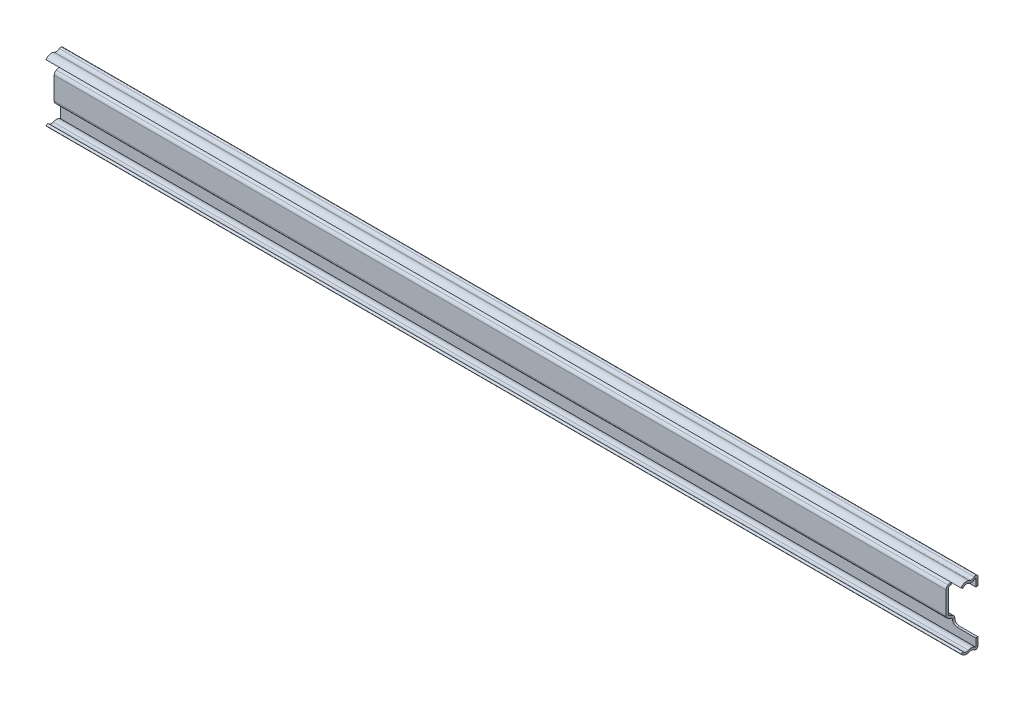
ISO-10303-21;
HEADER;
FILE_DESCRIPTION(('STEP AP214'),'2;1');
FILE_NAME('part.step','',(''),(''),'','','');
FILE_SCHEMA(('AUTOMOTIVE_DESIGN { 1 0 10303 214 1 1 1 1 }'));
ENDSEC;
DATA;
#1=APPLICATION_CONTEXT('core data for automotive mechanical design processes');
#2=APPLICATION_PROTOCOL_DEFINITION('international standard','automotive_design',2000,#1);
#3=PRODUCT_CONTEXT('',#1,'mechanical');
#4=PRODUCT('Part','Part','',(#3));
#5=PRODUCT_RELATED_PRODUCT_CATEGORY('part','',(#4));
#6=PRODUCT_DEFINITION_FORMATION('','',#4);
#7=PRODUCT_DEFINITION_CONTEXT('part definition',#1,'design');
#8=PRODUCT_DEFINITION('design','',#6,#7);
#9=PRODUCT_DEFINITION_SHAPE('','',#8);
#10=(LENGTH_UNIT() NAMED_UNIT(*) SI_UNIT(.MILLI.,.METRE.));
#11=(NAMED_UNIT(*) PLANE_ANGLE_UNIT() SI_UNIT($,.RADIAN.));
#12=(NAMED_UNIT(*) SI_UNIT($,.STERADIAN.) SOLID_ANGLE_UNIT());
#13=UNCERTAINTY_MEASURE_WITH_UNIT(LENGTH_MEASURE(1.E-05),#10,'distance_accuracy_value','');
#14=(GEOMETRIC_REPRESENTATION_CONTEXT(3) GLOBAL_UNCERTAINTY_ASSIGNED_CONTEXT((#13)) GLOBAL_UNIT_ASSIGNED_CONTEXT((#10,
#11,#12)) REPRESENTATION_CONTEXT('',''));
#15=CARTESIAN_POINT('',(0.,0.,0.));
#16=DIRECTION('',(0.,0.,1.));
#17=DIRECTION('',(1.,0.,0.));
#18=AXIS2_PLACEMENT_3D('',#15,#16,#17);
#19=CARTESIAN_POINT('',(-504.063,-16.3765728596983,-3.53059999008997));
#20=DIRECTION('',(0.,0.,-1.));
#21=DIRECTION('',(-1.,0.,0.));
#22=AXIS2_PLACEMENT_3D('',#19,#20,#21);
#23=PLANE('',#22);
#24=DIRECTION('',(0.,1.,0.));
#25=VECTOR('',#24,1.);
#26=CARTESIAN_POINT('',(-16.637,-12.065,-3.53059999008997));
#27=LINE('',#26,#25);
#28=CARTESIAN_POINT('',(-16.637,9.52173798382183,-3.53059999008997));
#29=VERTEX_POINT('',#28);
#30=CARTESIAN_POINT('',(-16.637,9.525,-3.53059999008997));
#31=VERTEX_POINT('',#30);
#32=EDGE_CURVE('E478',#29,#31,#27,.T.);
#33=ORIENTED_EDGE('',*,*,#32,.F.);
#34=DIRECTION('',(1.,0.,0.));
#35=VECTOR('',#34,1.);
#36=CARTESIAN_POINT('',(-504.063,9.52173798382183,-3.53059999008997));
#37=LINE('',#36,#35);
#38=CARTESIAN_POINT('',(-504.063,9.52173798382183,-3.53059999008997));
#39=VERTEX_POINT('',#38);
#40=EDGE_CURVE('E424',#29,#39,#37,.F.);
#41=ORIENTED_EDGE('',*,*,#40,.T.);
#42=DIRECTION('',(0.,1.,0.));
#43=VECTOR('',#42,1.);
#44=CARTESIAN_POINT('',(-504.063,-16.3765728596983,-3.53059999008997));
#45=LINE('',#44,#43);
#46=CARTESIAN_POINT('',(-504.063,16.3765728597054,-3.53059999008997));
#47=VERTEX_POINT('',#46);
#48=EDGE_CURVE('E528',#39,#47,#45,.T.);
#49=ORIENTED_EDGE('',*,*,#48,.T.);
#50=DIRECTION('',(1.,0.,0.));
#51=VECTOR('',#50,1.);
#52=CARTESIAN_POINT('',(-504.063,16.3765728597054,-3.53059999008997));
#53=LINE('',#52,#51);
#54=CARTESIAN_POINT('',(-3.93699999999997,16.3765728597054,-3.53059999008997));
#55=VERTEX_POINT('',#54);
#56=EDGE_CURVE('E295',#47,#55,#53,.T.);
#57=ORIENTED_EDGE('',*,*,#56,.T.);
#58=DIRECTION('',(0.,1.,0.));
#59=VECTOR('',#58,1.);
#60=CARTESIAN_POINT('',(-3.93699999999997,-16.3765728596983,-3.53059999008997));
#61=LINE('',#60,#59);
#62=CARTESIAN_POINT('',(-3.93699999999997,12.065,-3.53059999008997));
#63=VERTEX_POINT('',#62);
#64=EDGE_CURVE('E284',#63,#55,#61,.T.);
#65=ORIENTED_EDGE('',*,*,#64,.F.);
#66=DIRECTION('',(1.,0.,0.));
#67=VECTOR('',#66,1.);
#68=CARTESIAN_POINT('',(-16.637,12.065,-3.53059999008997));
#69=LINE('',#68,#67);
#70=CARTESIAN_POINT('',(-14.097,12.065,-3.53059999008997));
#71=VERTEX_POINT('',#70);
#72=EDGE_CURVE('E269',#71,#63,#69,.T.);
#73=ORIENTED_EDGE('',*,*,#72,.F.);
#74=CARTESIAN_POINT('',(-14.097,9.525,-3.53059999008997));
#75=DIRECTION('',(0.,0.,-1.));
#76=DIRECTION('',(-1.,0.,0.));
#77=AXIS2_PLACEMENT_3D('',#74,#75,#76);
#78=CIRCLE('',#77,2.54);
#79=EDGE_CURVE('E45',#71,#31,#78,.F.);
#80=ORIENTED_EDGE('',*,*,#79,.T.);
#81=EDGE_LOOP('',(#33,#41,#49,#57,#65,#73,#80));
#82=FACE_BOUND('',#81,.T.);
#83=ADVANCED_FACE('F36',(#82),#23,.T.);
#84=CARTESIAN_POINT('',(-504.063,16.3765728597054,-2.31139998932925));
#85=DIRECTION('',(0.,0.,1.));
#86=DIRECTION('',(1.,0.,0.));
#87=AXIS2_PLACEMENT_3D('',#84,#85,#86);
#88=PLANE('',#87);
#89=DIRECTION('',(0.,-1.,0.));
#90=VECTOR('',#89,1.);
#91=CARTESIAN_POINT('',(-16.637,16.3765728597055,-2.31139998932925));
#92=LINE('',#91,#90);
#93=CARTESIAN_POINT('',(-16.637,-9.52173798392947,-2.31139998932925));
#94=VERTEX_POINT('',#93);
#95=CARTESIAN_POINT('',(-16.637,-9.52499999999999,-2.31139998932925));
#96=VERTEX_POINT('',#95);
#97=EDGE_CURVE('E290',#94,#96,#92,.T.);
#98=ORIENTED_EDGE('',*,*,#97,.F.);
#99=DIRECTION('',(-1.,0.,0.));
#100=VECTOR('',#99,1.);
#101=CARTESIAN_POINT('',(-504.063,-9.52173798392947,-2.31139998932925));
#102=LINE('',#101,#100);
#103=CARTESIAN_POINT('',(-504.063,-9.52173798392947,-2.31139998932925));
#104=VERTEX_POINT('',#103);
#105=EDGE_CURVE('E403',#94,#104,#102,.T.);
#106=ORIENTED_EDGE('',*,*,#105,.T.);
#107=DIRECTION('',(0.,-1.,0.));
#108=VECTOR('',#107,1.);
#109=CARTESIAN_POINT('',(-504.063,16.3765728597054,-2.31139998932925));
#110=LINE('',#109,#108);
#111=CARTESIAN_POINT('',(-504.063,-16.3765728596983,-2.31139998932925));
#112=VERTEX_POINT('',#111);
#113=EDGE_CURVE('E633',#104,#112,#110,.T.);
#114=ORIENTED_EDGE('',*,*,#113,.T.);
#115=DIRECTION('',(1.,0.,0.));
#116=VECTOR('',#115,1.);
#117=CARTESIAN_POINT('',(-504.063,-16.3765728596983,-2.31139998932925));
#118=LINE('',#117,#116);
#119=CARTESIAN_POINT('',(-3.93699999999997,-16.3765728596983,-2.31139998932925));
#120=VERTEX_POINT('',#119);
#121=EDGE_CURVE('E349',#112,#120,#118,.T.);
#122=ORIENTED_EDGE('',*,*,#121,.T.);
#123=DIRECTION('',(0.,-1.,0.));
#124=VECTOR('',#123,1.);
#125=CARTESIAN_POINT('',(-3.93699999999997,16.3765728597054,-2.31139998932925));
#126=LINE('',#125,#124);
#127=CARTESIAN_POINT('',(-3.93699999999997,-12.065,-2.31139998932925));
#128=VERTEX_POINT('',#127);
#129=EDGE_CURVE('E583',#128,#120,#126,.T.);
#130=ORIENTED_EDGE('',*,*,#129,.F.);
#131=DIRECTION('',(1.,0.,0.));
#132=VECTOR('',#131,1.);
#133=CARTESIAN_POINT('',(-504.063,-12.0649999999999,-2.31139998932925));
#134=LINE('',#133,#132);
#135=CARTESIAN_POINT('',(-14.097,-12.065,-2.31139998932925));
#136=VERTEX_POINT('',#135);
#137=EDGE_CURVE('E613',#136,#128,#134,.T.);
#138=ORIENTED_EDGE('',*,*,#137,.F.);
#139=CARTESIAN_POINT('',(-14.097,-9.52499999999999,-2.31139998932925));
#140=DIRECTION('',(0.,0.,1.));
#141=DIRECTION('',(1.,0.,0.));
#142=AXIS2_PLACEMENT_3D('',#139,#140,#141);
#143=CIRCLE('',#142,2.54);
#144=EDGE_CURVE('E473',#136,#96,#143,.F.);
#145=ORIENTED_EDGE('',*,*,#144,.T.);
#146=EDGE_LOOP('',(#98,#106,#114,#122,#130,#138,#145));
#147=FACE_BOUND('',#146,.T.);
#148=ADVANCED_FACE('F494',(#147),#88,.T.);
#149=CARTESIAN_POINT('',(-504.063,16.3765728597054,-2.31139998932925));
#150=VERTEX_POINT('',#149);
#151=CARTESIAN_POINT('',(-504.063,9.52173798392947,-2.31139998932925));
#152=VERTEX_POINT('',#151);
#153=EDGE_CURVE('E634',#150,#152,#110,.T.);
#154=ORIENTED_EDGE('',*,*,#153,.T.);
#155=DIRECTION('',(1.,0.,0.));
#156=VECTOR('',#155,1.);
#157=CARTESIAN_POINT('',(-504.063,9.52173798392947,-2.31139998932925));
#158=LINE('',#157,#156);
#159=CARTESIAN_POINT('',(-16.637,9.52173798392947,-2.31139998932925));
#160=VERTEX_POINT('',#159);
#161=EDGE_CURVE('E397',#152,#160,#158,.T.);
#162=ORIENTED_EDGE('',*,*,#161,.T.);
#163=CARTESIAN_POINT('',(-16.637,9.525,-2.31139998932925));
#164=VERTEX_POINT('',#163);
#165=EDGE_CURVE('E356',#164,#160,#92,.T.);
#166=ORIENTED_EDGE('',*,*,#165,.F.);
#167=CARTESIAN_POINT('',(-14.097,9.525,-2.31139998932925));
#168=DIRECTION('',(0.,0.,1.));
#169=DIRECTION('',(1.,0.,0.));
#170=AXIS2_PLACEMENT_3D('',#167,#168,#169);
#171=CIRCLE('',#170,2.54);
#172=CARTESIAN_POINT('',(-14.097,12.065,-2.31139998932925));
#173=VERTEX_POINT('',#172);
#174=EDGE_CURVE('E11',#164,#173,#171,.F.);
#175=ORIENTED_EDGE('',*,*,#174,.T.);
#176=DIRECTION('',(-1.,0.,0.));
#177=VECTOR('',#176,1.);
#178=CARTESIAN_POINT('',(-504.063,12.0649999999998,-2.31139998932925));
#179=LINE('',#178,#177);
#180=CARTESIAN_POINT('',(-3.93699999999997,12.065,-2.31139998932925));
#181=VERTEX_POINT('',#180);
#182=EDGE_CURVE('E584',#181,#173,#179,.T.);
#183=ORIENTED_EDGE('',*,*,#182,.F.);
#184=CARTESIAN_POINT('',(-3.93699999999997,16.3765728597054,-2.31139998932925));
#185=VERTEX_POINT('',#184);
#186=EDGE_CURVE('E288',#185,#181,#126,.T.);
#187=ORIENTED_EDGE('',*,*,#186,.F.);
#188=DIRECTION('',(1.,0.,0.));
#189=VECTOR('',#188,1.);
#190=CARTESIAN_POINT('',(-504.063,16.3765728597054,-2.31139998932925));
#191=LINE('',#190,#189);
#192=EDGE_CURVE('E352',#150,#185,#191,.T.);
#193=ORIENTED_EDGE('',*,*,#192,.F.);
#194=EDGE_LOOP('',(#154,#162,#166,#175,#183,#187,#193));
#195=FACE_BOUND('',#194,.T.);
#196=ADVANCED_FACE('F500',(#195),#88,.T.);
#197=CARTESIAN_POINT('',(-3.93699999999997,19.1743717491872,0.152399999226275));
#198=DIRECTION('',(1.,0.,0.));
#199=DIRECTION('',(0.,0.,-1.));
#200=AXIS2_PLACEMENT_3D('',#197,#198,#199);
#201=PLANE('',#200);
#202=DIRECTION('',(0.,0.,1.));
#203=VECTOR('',#202,1.);
#204=CARTESIAN_POINT('',(-3.93699999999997,12.065,0.152399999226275));
#205=LINE('',#204,#203);
#206=EDGE_CURVE('E272',#63,#181,#205,.T.);
#207=ORIENTED_EDGE('',*,*,#206,.F.);
#208=ORIENTED_EDGE('',*,*,#64,.T.);
#209=CARTESIAN_POINT('',(-3.93699999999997,16.3765728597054,-2.31139998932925));
#210=DIRECTION('',(1.,0.,0.));
#211=DIRECTION('',(0.,0.,-1.));
#212=AXIS2_PLACEMENT_3D('',#209,#210,#211);
#213=CIRCLE('',#212,1.21920000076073);
#214=CARTESIAN_POINT('',(-3.93699999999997,17.2915609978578,-1.50564236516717));
#215=VERTEX_POINT('',#214);
#216=EDGE_CURVE('E302',#55,#215,#213,.T.);
#217=ORIENTED_EDGE('',*,*,#216,.T.);
#218=CARTESIAN_POINT('',(-3.93699999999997,19.1743717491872,0.152399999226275));
#219=DIRECTION('',(-1.,0.,0.));
#220=DIRECTION('',(0.,0.,1.));
#221=AXIS2_PLACEMENT_3D('',#218,#219,#220);
#222=CIRCLE('',#221,2.50880067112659);
#223=CARTESIAN_POINT('',(-3.93699999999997,16.9142836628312,1.24147421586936));
#224=VERTEX_POINT('',#223);
#225=EDGE_CURVE('E310',#215,#224,#222,.T.);
#226=ORIENTED_EDGE('',*,*,#225,.T.);
#227=CARTESIAN_POINT('',(-3.93699999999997,13.7451343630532,2.7686));
#228=DIRECTION('',(1.,0.,0.));
#229=DIRECTION('',(0.,0.,-1.));
#230=AXIS2_PLACEMENT_3D('',#227,#228,#229);
#231=CIRCLE('',#230,3.51790000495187);
#232=CARTESIAN_POINT('',(-3.93699999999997,15.627692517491,5.7404));
#233=VERTEX_POINT('',#232);
#234=EDGE_CURVE('E313',#224,#233,#231,.T.);
#235=ORIENTED_EDGE('',*,*,#234,.T.);
#236=DIRECTION('',(0.,-0.535136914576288,-0.844765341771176));
#237=VECTOR('',#236,1.);
#238=CARTESIAN_POINT('',(-3.93699999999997,15.627692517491,5.7404));
#239=LINE('',#238,#237);
#240=CARTESIAN_POINT('',(-3.93699999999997,14.9752535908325,4.71046209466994));
#241=VERTEX_POINT('',#240);
#242=EDGE_CURVE('E317',#233,#241,#239,.T.);
#243=ORIENTED_EDGE('',*,*,#242,.T.);
#244=CARTESIAN_POINT('',(-3.93699999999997,13.7451343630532,2.7686));
#245=DIRECTION('',(-1.,0.,0.));
#246=DIRECTION('',(0.,0.,1.));
#247=AXIS2_PLACEMENT_3D('',#244,#245,#246);
#248=CIRCLE('',#247,2.29870000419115);
#249=CARTESIAN_POINT('',(-3.93699999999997,15.8159503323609,1.7707308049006));
#250=VERTEX_POINT('',#249);
#251=EDGE_CURVE('E320',#241,#250,#248,.T.);
#252=ORIENTED_EDGE('',*,*,#251,.T.);
#253=CARTESIAN_POINT('',(-3.93699999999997,19.1743717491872,0.152399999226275));
#254=DIRECTION('',(1.,0.,0.));
#255=DIRECTION('',(0.,0.,-1.));
#256=AXIS2_PLACEMENT_3D('',#253,#254,#255);
#257=CIRCLE('',#256,3.72800067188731);
#258=EDGE_CURVE('E581',#250,#185,#257,.T.);
#259=ORIENTED_EDGE('',*,*,#258,.T.);
#260=ORIENTED_EDGE('',*,*,#186,.T.);
#261=EDGE_LOOP('',(#207,#208,#217,#226,#235,#243,#252,#259,#260));
#262=FACE_BOUND('',#261,.T.);
#263=ADVANCED_FACE('F282',(#262),#201,.T.);
#264=CARTESIAN_POINT('',(-504.063,19.1743717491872,0.152399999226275));
#265=DIRECTION('',(1.,0.,0.));
#266=DIRECTION('',(0.,0.,-1.));
#267=AXIS2_PLACEMENT_3D('',#264,#265,#266);
#268=CYLINDRICAL_SURFACE('',#267,3.72800067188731);
#269=ORIENTED_EDGE('',*,*,#258,.F.);
#270=DIRECTION('',(1.,0.,0.));
#271=VECTOR('',#270,1.);
#272=CARTESIAN_POINT('',(-504.063,15.8159503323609,1.7707308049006));
#273=LINE('',#272,#271);
#274=CARTESIAN_POINT('',(-504.063,15.8159503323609,1.7707308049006));
#275=VERTEX_POINT('',#274);
#276=EDGE_CURVE('E325',#275,#250,#273,.T.);
#277=ORIENTED_EDGE('',*,*,#276,.F.);
#278=CARTESIAN_POINT('',(-504.063,19.1743717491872,0.152399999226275));
#279=DIRECTION('',(1.,0.,0.));
#280=DIRECTION('',(0.,0.,-1.));
#281=AXIS2_PLACEMENT_3D('',#278,#279,#280);
#282=CIRCLE('',#281,3.72800067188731);
#283=EDGE_CURVE('E324',#275,#150,#282,.T.);
#284=ORIENTED_EDGE('',*,*,#283,.T.);
#285=ORIENTED_EDGE('',*,*,#192,.T.);
#286=EDGE_LOOP('',(#269,#277,#284,#285));
#287=FACE_BOUND('',#286,.T.);
#288=ADVANCED_FACE('F672',(#287),#268,.T.);
#289=CARTESIAN_POINT('',(-504.063,13.7451343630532,2.7686));
#290=DIRECTION('',(1.,0.,0.));
#291=DIRECTION('',(0.,0.,-1.));
#292=AXIS2_PLACEMENT_3D('',#289,#290,#291);
#293=CYLINDRICAL_SURFACE('',#292,2.29870000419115);
#294=ORIENTED_EDGE('',*,*,#251,.F.);
#295=DIRECTION('',(1.,0.,0.));
#296=VECTOR('',#295,1.);
#297=CARTESIAN_POINT('',(-504.063,14.9752535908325,4.71046209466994));
#298=LINE('',#297,#296);
#299=CARTESIAN_POINT('',(-504.063,14.9752535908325,4.71046209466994));
#300=VERTEX_POINT('',#299);
#301=EDGE_CURVE('E327',#300,#241,#298,.T.);
#302=ORIENTED_EDGE('',*,*,#301,.F.);
#303=CARTESIAN_POINT('',(-504.063,13.7451343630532,2.7686));
#304=DIRECTION('',(-1.,0.,0.));
#305=DIRECTION('',(0.,0.,1.));
#306=AXIS2_PLACEMENT_3D('',#303,#304,#305);
#307=CIRCLE('',#306,2.29870000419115);
#308=EDGE_CURVE('E354',#300,#275,#307,.T.);
#309=ORIENTED_EDGE('',*,*,#308,.T.);
#310=ORIENTED_EDGE('',*,*,#276,.T.);
#311=EDGE_LOOP('',(#294,#302,#309,#310));
#312=FACE_BOUND('',#311,.T.);
#313=ADVANCED_FACE('F675',(#312),#293,.F.);
#314=CARTESIAN_POINT('',(-504.063,15.627692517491,5.7404));
#315=DIRECTION('',(0.,-0.844765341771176,0.535136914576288));
#316=DIRECTION('',(0.,-0.535136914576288,-0.844765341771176));
#317=AXIS2_PLACEMENT_3D('',#314,#315,#316);
#318=PLANE('',#317);
#319=ORIENTED_EDGE('',*,*,#242,.F.);
#320=DIRECTION('',(1.,0.,0.));
#321=VECTOR('',#320,1.);
#322=CARTESIAN_POINT('',(-504.063,15.627692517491,5.7404));
#323=LINE('',#322,#321);
#324=CARTESIAN_POINT('',(-504.063,15.627692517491,5.7404));
#325=VERTEX_POINT('',#324);
#326=EDGE_CURVE('E329',#325,#233,#323,.T.);
#327=ORIENTED_EDGE('',*,*,#326,.F.);
#328=DIRECTION('',(0.,-0.535136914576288,-0.844765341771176));
#329=VECTOR('',#328,1.);
#330=CARTESIAN_POINT('',(-504.063,15.627692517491,5.7404));
#331=LINE('',#330,#329);
#332=EDGE_CURVE('E576',#325,#300,#331,.T.);
#333=ORIENTED_EDGE('',*,*,#332,.T.);
#334=ORIENTED_EDGE('',*,*,#301,.T.);
#335=EDGE_LOOP('',(#319,#327,#333,#334));
#336=FACE_BOUND('',#335,.T.);
#337=ADVANCED_FACE('F952',(#336),#318,.T.);
#338=CARTESIAN_POINT('',(-504.063,13.7451343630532,2.7686));
#339=DIRECTION('',(1.,0.,0.));
#340=DIRECTION('',(0.,0.,-1.));
#341=AXIS2_PLACEMENT_3D('',#338,#339,#340);
#342=CYLINDRICAL_SURFACE('',#341,3.51790000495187);
#343=ORIENTED_EDGE('',*,*,#234,.F.);
#344=DIRECTION('',(1.,0.,0.));
#345=VECTOR('',#344,1.);
#346=CARTESIAN_POINT('',(-504.063,16.9142836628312,1.24147421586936));
#347=LINE('',#346,#345);
#348=CARTESIAN_POINT('',(-504.063,16.9142836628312,1.24147421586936));
#349=VERTEX_POINT('',#348);
#350=EDGE_CURVE('E331',#349,#224,#347,.T.);
#351=ORIENTED_EDGE('',*,*,#350,.F.);
#352=CARTESIAN_POINT('',(-504.063,13.7451343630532,2.7686));
#353=DIRECTION('',(1.,0.,0.));
#354=DIRECTION('',(0.,0.,-1.));
#355=AXIS2_PLACEMENT_3D('',#352,#353,#354);
#356=CIRCLE('',#355,3.51790000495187);
#357=EDGE_CURVE('E572',#349,#325,#356,.T.);
#358=ORIENTED_EDGE('',*,*,#357,.T.);
#359=ORIENTED_EDGE('',*,*,#326,.T.);
#360=EDGE_LOOP('',(#343,#351,#358,#359));
#361=FACE_BOUND('',#360,.T.);
#362=ADVANCED_FACE('F942',(#361),#342,.T.);
#363=CARTESIAN_POINT('',(-504.063,19.1743717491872,0.152399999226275));
#364=DIRECTION('',(1.,0.,0.));
#365=DIRECTION('',(0.,0.,-1.));
#366=AXIS2_PLACEMENT_3D('',#363,#364,#365);
#367=CYLINDRICAL_SURFACE('',#366,2.50880067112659);
#368=ORIENTED_EDGE('',*,*,#225,.F.);
#369=DIRECTION('',(1.,0.,0.));
#370=VECTOR('',#369,1.);
#371=CARTESIAN_POINT('',(-504.063,17.2915609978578,-1.50564236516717));
#372=LINE('',#371,#370);
#373=CARTESIAN_POINT('',(-504.063,17.2915609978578,-1.50564236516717));
#374=VERTEX_POINT('',#373);
#375=EDGE_CURVE('E333',#374,#215,#372,.T.);
#376=ORIENTED_EDGE('',*,*,#375,.F.);
#377=CARTESIAN_POINT('',(-504.063,19.1743717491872,0.152399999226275));
#378=DIRECTION('',(-1.,0.,0.));
#379=DIRECTION('',(0.,0.,1.));
#380=AXIS2_PLACEMENT_3D('',#377,#378,#379);
#381=CIRCLE('',#380,2.50880067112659);
#382=EDGE_CURVE('E569',#374,#349,#381,.T.);
#383=ORIENTED_EDGE('',*,*,#382,.T.);
#384=ORIENTED_EDGE('',*,*,#350,.T.);
#385=EDGE_LOOP('',(#368,#376,#383,#384));
#386=FACE_BOUND('',#385,.T.);
#387=ADVANCED_FACE('F515',(#386),#367,.F.);
#388=CARTESIAN_POINT('',(-504.063,16.3765728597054,-2.31139998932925));
#389=DIRECTION('',(1.,0.,0.));
#390=DIRECTION('',(0.,0.,-1.));
#391=AXIS2_PLACEMENT_3D('',#388,#389,#390);
#392=CYLINDRICAL_SURFACE('',#391,1.21920000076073);
#393=ORIENTED_EDGE('',*,*,#216,.F.);
#394=ORIENTED_EDGE('',*,*,#56,.F.);
#395=CARTESIAN_POINT('',(-504.063,16.3765728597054,-2.31139998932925));
#396=DIRECTION('',(1.,0.,0.));
#397=DIRECTION('',(0.,0.,-1.));
#398=AXIS2_PLACEMENT_3D('',#395,#396,#397);
#399=CIRCLE('',#398,1.21920000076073);
#400=EDGE_CURVE('E527',#47,#374,#399,.T.);
#401=ORIENTED_EDGE('',*,*,#400,.T.);
#402=ORIENTED_EDGE('',*,*,#375,.T.);
#403=EDGE_LOOP('',(#393,#394,#401,#402));
#404=FACE_BOUND('',#403,.T.);
#405=ADVANCED_FACE('F507',(#404),#392,.T.);
#406=CARTESIAN_POINT('',(-504.063,-16.3765728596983,-3.53059999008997));
#407=VERTEX_POINT('',#406);
#408=CARTESIAN_POINT('',(-504.063,-9.52173798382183,-3.53059999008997));
#409=VERTEX_POINT('',#408);
#410=EDGE_CURVE('E519',#407,#409,#45,.T.);
#411=ORIENTED_EDGE('',*,*,#410,.T.);
#412=DIRECTION('',(1.,0.,0.));
#413=VECTOR('',#412,1.);
#414=CARTESIAN_POINT('',(-16.637,-9.52173798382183,-3.53059999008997));
#415=LINE('',#414,#413);
#416=CARTESIAN_POINT('',(-16.637,-9.52173798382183,-3.53059999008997));
#417=VERTEX_POINT('',#416);
#418=EDGE_CURVE('E460',#409,#417,#415,.T.);
#419=ORIENTED_EDGE('',*,*,#418,.T.);
#420=CARTESIAN_POINT('',(-16.637,-9.52499999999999,-3.53059999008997));
#421=VERTEX_POINT('',#420);
#422=EDGE_CURVE('E484',#421,#417,#27,.T.);
#423=ORIENTED_EDGE('',*,*,#422,.F.);
#424=CARTESIAN_POINT('',(-14.097,-9.52499999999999,-3.53059999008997));
#425=DIRECTION('',(0.,0.,-1.));
#426=DIRECTION('',(-1.,0.,0.));
#427=AXIS2_PLACEMENT_3D('',#424,#425,#426);
#428=CIRCLE('',#427,2.54);
#429=CARTESIAN_POINT('',(-14.097,-12.065,-3.53059999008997));
#430=VERTEX_POINT('',#429);
#431=EDGE_CURVE('E471',#421,#430,#428,.F.);
#432=ORIENTED_EDGE('',*,*,#431,.T.);
#433=DIRECTION('',(-1.,0.,0.));
#434=VECTOR('',#433,1.);
#435=CARTESIAN_POINT('',(-3.93699999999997,-12.065,-3.53059999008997));
#436=LINE('',#435,#434);
#437=CARTESIAN_POINT('',(-3.93699999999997,-12.065,-3.53059999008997));
#438=VERTEX_POINT('',#437);
#439=EDGE_CURVE('E277',#438,#430,#436,.T.);
#440=ORIENTED_EDGE('',*,*,#439,.F.);
#441=CARTESIAN_POINT('',(-3.93699999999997,-16.3765728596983,-3.53059999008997));
#442=VERTEX_POINT('',#441);
#443=EDGE_CURVE('E297',#442,#438,#61,.T.);
#444=ORIENTED_EDGE('',*,*,#443,.F.);
#445=DIRECTION('',(1.,0.,0.));
#446=VECTOR('',#445,1.);
#447=CARTESIAN_POINT('',(-504.063,-16.3765728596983,-3.53059999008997));
#448=LINE('',#447,#446);
#449=EDGE_CURVE('E336',#407,#442,#448,.T.);
#450=ORIENTED_EDGE('',*,*,#449,.F.);
#451=EDGE_LOOP('',(#411,#419,#423,#432,#440,#444,#450));
#452=FACE_BOUND('',#451,.T.);
#453=ADVANCED_FACE('F496',(#452),#23,.T.);
#454=CARTESIAN_POINT('',(-504.063,-16.3765728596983,-2.31139998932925));
#455=DIRECTION('',(1.,0.,0.));
#456=DIRECTION('',(0.,0.,-1.));
#457=AXIS2_PLACEMENT_3D('',#454,#455,#456);
#458=CYLINDRICAL_SURFACE('',#457,1.21920000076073);
#459=CARTESIAN_POINT('',(-3.93699999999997,-16.3765728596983,-2.31139998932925));
#460=DIRECTION('',(1.,0.,0.));
#461=DIRECTION('',(0.,0.,-1.));
#462=AXIS2_PLACEMENT_3D('',#459,#460,#461);
#463=CIRCLE('',#462,1.21920000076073);
#464=CARTESIAN_POINT('',(-3.93699999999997,-17.2915609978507,-1.50564236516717));
#465=VERTEX_POINT('',#464);
#466=EDGE_CURVE('E298',#465,#442,#463,.T.);
#467=ORIENTED_EDGE('',*,*,#466,.F.);
#468=DIRECTION('',(1.,0.,0.));
#469=VECTOR('',#468,1.);
#470=CARTESIAN_POINT('',(-504.063,-17.2915609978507,-1.50564236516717));
#471=LINE('',#470,#469);
#472=CARTESIAN_POINT('',(-504.063,-17.2915609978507,-1.50564236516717));
#473=VERTEX_POINT('',#472);
#474=EDGE_CURVE('E338',#473,#465,#471,.T.);
#475=ORIENTED_EDGE('',*,*,#474,.F.);
#476=CARTESIAN_POINT('',(-504.063,-16.3765728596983,-2.31139998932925));
#477=DIRECTION('',(1.,0.,0.));
#478=DIRECTION('',(0.,0.,-1.));
#479=AXIS2_PLACEMENT_3D('',#476,#477,#478);
#480=CIRCLE('',#479,1.21920000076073);
#481=EDGE_CURVE('E563',#473,#407,#480,.T.);
#482=ORIENTED_EDGE('',*,*,#481,.T.);
#483=ORIENTED_EDGE('',*,*,#449,.T.);
#484=EDGE_LOOP('',(#467,#475,#482,#483));
#485=FACE_BOUND('',#484,.T.);
#486=ADVANCED_FACE('F506',(#485),#458,.T.);
#487=CARTESIAN_POINT('',(-504.063,-19.1743717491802,0.152399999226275));
#488=DIRECTION('',(1.,0.,0.));
#489=DIRECTION('',(0.,0.,-1.));
#490=AXIS2_PLACEMENT_3D('',#487,#488,#489);
#491=CYLINDRICAL_SURFACE('',#490,2.50880067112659);
#492=CARTESIAN_POINT('',(-3.93699999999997,-19.1743717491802,0.152399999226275));
#493=DIRECTION('',(-1.,0.,0.));
#494=DIRECTION('',(0.,0.,1.));
#495=AXIS2_PLACEMENT_3D('',#492,#493,#494);
#496=CIRCLE('',#495,2.50880067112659);
#497=CARTESIAN_POINT('',(-3.93699999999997,-16.9142836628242,1.24147421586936));
#498=VERTEX_POINT('',#497);
#499=EDGE_CURVE('E304',#498,#465,#496,.T.);
#500=ORIENTED_EDGE('',*,*,#499,.F.);
#501=DIRECTION('',(1.,0.,0.));
#502=VECTOR('',#501,1.);
#503=CARTESIAN_POINT('',(-504.063,-16.9142836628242,1.24147421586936));
#504=LINE('',#503,#502);
#505=CARTESIAN_POINT('',(-504.063,-16.9142836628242,1.24147421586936));
#506=VERTEX_POINT('',#505);
#507=EDGE_CURVE('E340',#506,#498,#504,.T.);
#508=ORIENTED_EDGE('',*,*,#507,.F.);
#509=CARTESIAN_POINT('',(-504.063,-19.1743717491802,0.152399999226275));
#510=DIRECTION('',(-1.,0.,0.));
#511=DIRECTION('',(0.,0.,1.));
#512=AXIS2_PLACEMENT_3D('',#509,#510,#511);
#513=CIRCLE('',#512,2.50880067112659);
#514=EDGE_CURVE('E564',#506,#473,#513,.T.);
#515=ORIENTED_EDGE('',*,*,#514,.T.);
#516=ORIENTED_EDGE('',*,*,#474,.T.);
#517=EDGE_LOOP('',(#500,#508,#515,#516));
#518=FACE_BOUND('',#517,.T.);
#519=ADVANCED_FACE('F513',(#518),#491,.F.);
#520=CARTESIAN_POINT('',(-504.063,-13.7451343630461,2.7686));
#521=DIRECTION('',(1.,0.,0.));
#522=DIRECTION('',(0.,0.,-1.));
#523=AXIS2_PLACEMENT_3D('',#520,#521,#522);
#524=CYLINDRICAL_SURFACE('',#523,3.51790000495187);
#525=CARTESIAN_POINT('',(-3.93699999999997,-13.7451343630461,2.7686));
#526=DIRECTION('',(1.,0.,0.));
#527=DIRECTION('',(0.,0.,-1.));
#528=AXIS2_PLACEMENT_3D('',#525,#526,#527);
#529=CIRCLE('',#528,3.51790000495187);
#530=CARTESIAN_POINT('',(-3.93699999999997,-15.6276925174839,5.7404));
#531=VERTEX_POINT('',#530);
#532=EDGE_CURVE('E595',#531,#498,#529,.T.);
#533=ORIENTED_EDGE('',*,*,#532,.F.);
#534=DIRECTION('',(1.,0.,0.));
#535=VECTOR('',#534,1.);
#536=CARTESIAN_POINT('',(-504.063,-15.6276925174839,5.7404));
#537=LINE('',#536,#535);
#538=CARTESIAN_POINT('',(-504.063,-15.6276925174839,5.7404));
#539=VERTEX_POINT('',#538);
#540=EDGE_CURVE('E343',#539,#531,#537,.T.);
#541=ORIENTED_EDGE('',*,*,#540,.F.);
#542=CARTESIAN_POINT('',(-504.063,-13.7451343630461,2.7686));
#543=DIRECTION('',(1.,0.,0.));
#544=DIRECTION('',(0.,0.,-1.));
#545=AXIS2_PLACEMENT_3D('',#542,#543,#544);
#546=CIRCLE('',#545,3.51790000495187);
#547=EDGE_CURVE('E646',#539,#506,#546,.T.);
#548=ORIENTED_EDGE('',*,*,#547,.T.);
#549=ORIENTED_EDGE('',*,*,#507,.T.);
#550=EDGE_LOOP('',(#533,#541,#548,#549));
#551=FACE_BOUND('',#550,.T.);
#552=ADVANCED_FACE('F650',(#551),#524,.T.);
#553=CARTESIAN_POINT('',(-504.063,-14.9752535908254,4.71046209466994));
#554=DIRECTION('',(0.,0.844765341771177,0.535136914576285));
#555=DIRECTION('',(0.,-0.535136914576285,0.844765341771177));
#556=AXIS2_PLACEMENT_3D('',#553,#554,#555);
#557=PLANE('',#556);
#558=DIRECTION('',(0.,-0.535136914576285,0.844765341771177));
#559=VECTOR('',#558,1.);
#560=CARTESIAN_POINT('',(-3.93699999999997,-14.9752535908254,4.71046209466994));
#561=LINE('',#560,#559);
#562=CARTESIAN_POINT('',(-3.93699999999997,-14.9752535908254,4.71046209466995));
#563=VERTEX_POINT('',#562);
#564=EDGE_CURVE('E592',#563,#531,#561,.T.);
#565=ORIENTED_EDGE('',*,*,#564,.F.);
#566=DIRECTION('',(1.,0.,0.));
#567=VECTOR('',#566,1.);
#568=CARTESIAN_POINT('',(-504.063,-14.9752535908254,4.71046209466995));
#569=LINE('',#568,#567);
#570=CARTESIAN_POINT('',(-504.063,-14.9752535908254,4.71046209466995));
#571=VERTEX_POINT('',#570);
#572=EDGE_CURVE('E345',#571,#563,#569,.T.);
#573=ORIENTED_EDGE('',*,*,#572,.F.);
#574=DIRECTION('',(0.,-0.535136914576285,0.844765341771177));
#575=VECTOR('',#574,1.);
#576=CARTESIAN_POINT('',(-504.063,-14.9752535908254,4.71046209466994));
#577=LINE('',#576,#575);
#578=EDGE_CURVE('E643',#571,#539,#577,.T.);
#579=ORIENTED_EDGE('',*,*,#578,.T.);
#580=ORIENTED_EDGE('',*,*,#540,.T.);
#581=EDGE_LOOP('',(#565,#573,#579,#580));
#582=FACE_BOUND('',#581,.T.);
#583=ADVANCED_FACE('F655',(#582),#557,.T.);
#584=CARTESIAN_POINT('',(-504.063,-13.7451343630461,2.7686));
#585=DIRECTION('',(1.,0.,0.));
#586=DIRECTION('',(0.,0.,-1.));
#587=AXIS2_PLACEMENT_3D('',#584,#585,#586);
#588=CYLINDRICAL_SURFACE('',#587,2.29870000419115);
#589=CARTESIAN_POINT('',(-3.93699999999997,-13.7451343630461,2.7686));
#590=DIRECTION('',(-1.,0.,0.));
#591=DIRECTION('',(0.,0.,1.));
#592=AXIS2_PLACEMENT_3D('',#589,#590,#591);
#593=CIRCLE('',#592,2.29870000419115);
#594=CARTESIAN_POINT('',(-3.93699999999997,-15.8159503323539,1.7707308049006));
#595=VERTEX_POINT('',#594);
#596=EDGE_CURVE('E589',#595,#563,#593,.T.);
#597=ORIENTED_EDGE('',*,*,#596,.F.);
#598=DIRECTION('',(1.,0.,0.));
#599=VECTOR('',#598,1.);
#600=CARTESIAN_POINT('',(-504.063,-15.8159503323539,1.7707308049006));
#601=LINE('',#600,#599);
#602=CARTESIAN_POINT('',(-504.063,-15.8159503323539,1.7707308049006));
#603=VERTEX_POINT('',#602);
#604=EDGE_CURVE('E347',#603,#595,#601,.T.);
#605=ORIENTED_EDGE('',*,*,#604,.F.);
#606=CARTESIAN_POINT('',(-504.063,-13.7451343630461,2.7686));
#607=DIRECTION('',(-1.,0.,0.));
#608=DIRECTION('',(0.,0.,1.));
#609=AXIS2_PLACEMENT_3D('',#606,#607,#608);
#610=CIRCLE('',#609,2.29870000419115);
#611=EDGE_CURVE('E640',#603,#571,#610,.T.);
#612=ORIENTED_EDGE('',*,*,#611,.T.);
#613=ORIENTED_EDGE('',*,*,#572,.T.);
#614=EDGE_LOOP('',(#597,#605,#612,#613));
#615=FACE_BOUND('',#614,.T.);
#616=ADVANCED_FACE('F658',(#615),#588,.F.);
#617=CARTESIAN_POINT('',(-504.063,-19.1743717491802,0.152399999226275));
#618=DIRECTION('',(1.,0.,0.));
#619=DIRECTION('',(0.,0.,-1.));
#620=AXIS2_PLACEMENT_3D('',#617,#618,#619);
#621=CYLINDRICAL_SURFACE('',#620,3.72800067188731);
#622=CARTESIAN_POINT('',(-3.93699999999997,-19.1743717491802,0.152399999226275));
#623=DIRECTION('',(1.,0.,0.));
#624=DIRECTION('',(0.,0.,-1.));
#625=AXIS2_PLACEMENT_3D('',#622,#623,#624);
#626=CIRCLE('',#625,3.72800067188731);
#627=EDGE_CURVE('E586',#120,#595,#626,.T.);
#628=ORIENTED_EDGE('',*,*,#627,.F.);
#629=ORIENTED_EDGE('',*,*,#121,.F.);
#630=CARTESIAN_POINT('',(-504.063,-19.1743717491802,0.152399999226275));
#631=DIRECTION('',(1.,0.,0.));
#632=DIRECTION('',(0.,0.,-1.));
#633=AXIS2_PLACEMENT_3D('',#630,#631,#632);
#634=CIRCLE('',#633,3.72800067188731);
#635=EDGE_CURVE('E637',#112,#603,#634,.T.);
#636=ORIENTED_EDGE('',*,*,#635,.T.);
#637=ORIENTED_EDGE('',*,*,#604,.T.);
#638=EDGE_LOOP('',(#628,#629,#636,#637));
#639=FACE_BOUND('',#638,.T.);
#640=ADVANCED_FACE('F662',(#639),#621,.T.);
#641=CARTESIAN_POINT('',(-504.063,19.1743717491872,0.152399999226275));
#642=DIRECTION('',(1.,0.,0.));
#643=DIRECTION('',(0.,0.,-1.));
#644=AXIS2_PLACEMENT_3D('',#641,#642,#643);
#645=PLANE('',#644);
#646=ORIENTED_EDGE('',*,*,#48,.F.);
#647=CARTESIAN_POINT('',(-504.063,9.52173798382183,-1.54939990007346));
#648=DIRECTION('',(1.,0.,0.));
#649=DIRECTION('',(0.,0.,-1.));
#650=AXIS2_PLACEMENT_3D('',#647,#648,#649);
#651=CIRCLE('',#650,1.98120009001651);
#652=CARTESIAN_POINT('',(-504.063,7.72616091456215,-2.38669123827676));
#653=VERTEX_POINT('',#652);
#654=EDGE_CURVE('E433',#39,#653,#651,.F.);
#655=ORIENTED_EDGE('',*,*,#654,.T.);
#656=DIRECTION('',(0.,-0.4226182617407,0.90630778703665));
#657=VECTOR('',#656,1.);
#658=CARTESIAN_POINT('',(-504.063,6.60138429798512,0.025400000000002));
#659=LINE('',#658,#657);
#660=CARTESIAN_POINT('',(-504.063,6.80654331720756,-0.414564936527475));
#661=VERTEX_POINT('',#660);
#662=EDGE_CURVE('E376',#661,#653,#659,.F.);
#663=ORIENTED_EDGE('',*,*,#662,.F.);
#664=CARTESIAN_POINT('',(-504.063,6.11593670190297,-0.73660009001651));
#665=DIRECTION('',(1.,0.,0.));
#666=DIRECTION('',(0.,0.,-1.));
#667=AXIS2_PLACEMENT_3D('',#664,#665,#666);
#668=CIRCLE('',#667,0.762000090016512);
#669=CARTESIAN_POINT('',(-504.063,6.11593670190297,0.025400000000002));
#670=VERTEX_POINT('',#669);
#671=EDGE_CURVE('E405',#661,#670,#668,.T.);
#672=ORIENTED_EDGE('',*,*,#671,.T.);
#673=DIRECTION('',(0.,1.,0.));
#674=VECTOR('',#673,1.);
#675=CARTESIAN_POINT('',(-504.063,-6.60138429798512,0.025400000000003));
#676=LINE('',#675,#674);
#677=CARTESIAN_POINT('',(-504.063,-6.11593670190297,0.025400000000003));
#678=VERTEX_POINT('',#677);
#679=EDGE_CURVE('E383',#678,#670,#676,.T.);
#680=ORIENTED_EDGE('',*,*,#679,.F.);
#681=CARTESIAN_POINT('',(-504.063,-6.11593670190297,-0.736600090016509));
#682=DIRECTION('',(1.,0.,0.));
#683=DIRECTION('',(0.,0.,-1.));
#684=AXIS2_PLACEMENT_3D('',#681,#682,#683);
#685=CIRCLE('',#684,0.762000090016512);
#686=CARTESIAN_POINT('',(-504.063,-6.80654331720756,-0.414564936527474));
#687=VERTEX_POINT('',#686);
#688=EDGE_CURVE('E409',#678,#687,#685,.T.);
#689=ORIENTED_EDGE('',*,*,#688,.T.);
#690=DIRECTION('',(0.,-0.4226182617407,-0.90630778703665));
#691=VECTOR('',#690,1.);
#692=CARTESIAN_POINT('',(-504.063,-6.60138429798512,0.025400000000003));
#693=LINE('',#692,#691);
#694=CARTESIAN_POINT('',(-504.063,-7.72616091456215,-2.38669123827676));
#695=VERTEX_POINT('',#694);
#696=EDGE_CURVE('E380',#695,#687,#693,.F.);
#697=ORIENTED_EDGE('',*,*,#696,.F.);
#698=CARTESIAN_POINT('',(-504.063,-9.52173798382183,-1.54939990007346));
#699=DIRECTION('',(1.,0.,0.));
#700=DIRECTION('',(0.,0.,-1.));
#701=AXIS2_PLACEMENT_3D('',#698,#699,#700);
#702=CIRCLE('',#701,1.98120009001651);
#703=EDGE_CURVE('E427',#695,#409,#702,.F.);
#704=ORIENTED_EDGE('',*,*,#703,.T.);
#705=ORIENTED_EDGE('',*,*,#410,.F.);
#706=ORIENTED_EDGE('',*,*,#481,.F.);
#707=ORIENTED_EDGE('',*,*,#514,.F.);
#708=ORIENTED_EDGE('',*,*,#547,.F.);
#709=ORIENTED_EDGE('',*,*,#578,.F.);
#710=ORIENTED_EDGE('',*,*,#611,.F.);
#711=ORIENTED_EDGE('',*,*,#635,.F.);
#712=ORIENTED_EDGE('',*,*,#113,.F.);
#713=CARTESIAN_POINT('',(-504.063,-9.52173798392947,-1.54939989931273));
#714=DIRECTION('',(1.,0.,0.));
#715=DIRECTION('',(0.,0.,-1.));
#716=AXIS2_PLACEMENT_3D('',#713,#714,#715);
#717=CIRCLE('',#716,0.762000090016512);
#718=CARTESIAN_POINT('',(-504.063,-8.83113136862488,-1.87143505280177));
#719=VERTEX_POINT('',#718);
#720=EDGE_CURVE('E421',#104,#719,#717,.T.);
#721=ORIENTED_EDGE('',*,*,#720,.T.);
#722=DIRECTION('',(0.,0.4226182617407,0.90630778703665));
#723=VECTOR('',#722,1.);
#724=CARTESIAN_POINT('',(-504.063,-7.37810035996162,1.24460000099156));
#725=LINE('',#724,#723);
#726=CARTESIAN_POINT('',(-504.063,-7.91151377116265,0.100691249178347));
#727=VERTEX_POINT('',#726);
#728=EDGE_CURVE('E369',#727,#719,#725,.F.);
#729=ORIENTED_EDGE('',*,*,#728,.F.);
#730=CARTESIAN_POINT('',(-504.063,-6.11593670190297,-0.73660008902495));
#731=DIRECTION('',(1.,0.,0.));
#732=DIRECTION('',(0.,0.,-1.));
#733=AXIS2_PLACEMENT_3D('',#730,#731,#732);
#734=CIRCLE('',#733,1.98120009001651);
#735=CARTESIAN_POINT('',(-504.063,-6.11593670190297,1.24460000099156));
#736=VERTEX_POINT('',#735);
#737=EDGE_CURVE('E429',#727,#736,#734,.F.);
#738=ORIENTED_EDGE('',*,*,#737,.T.);
#739=DIRECTION('',(0.,-1.,0.));
#740=VECTOR('',#739,1.);
#741=CARTESIAN_POINT('',(-504.063,-7.37810035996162,1.24460000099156));
#742=LINE('',#741,#740);
#743=CARTESIAN_POINT('',(-504.063,6.11593670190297,1.24460000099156));
#744=VERTEX_POINT('',#743);
#745=EDGE_CURVE('E371',#744,#736,#742,.T.);
#746=ORIENTED_EDGE('',*,*,#745,.F.);
#747=CARTESIAN_POINT('',(-504.063,6.11593670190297,-0.73660008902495));
#748=DIRECTION('',(1.,0.,0.));
#749=DIRECTION('',(0.,0.,-1.));
#750=AXIS2_PLACEMENT_3D('',#747,#748,#749);
#751=CIRCLE('',#750,1.98120009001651);
#752=CARTESIAN_POINT('',(-504.063,7.91151377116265,0.100691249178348));
#753=VERTEX_POINT('',#752);
#754=EDGE_CURVE('E431',#744,#753,#751,.F.);
#755=ORIENTED_EDGE('',*,*,#754,.T.);
#756=DIRECTION('',(0.,-0.4226182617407,0.90630778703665));
#757=VECTOR('',#756,1.);
#758=CARTESIAN_POINT('',(-504.063,9.90332438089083,-4.17076038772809));
#759=LINE('',#758,#757);
#760=CARTESIAN_POINT('',(-504.063,8.83113136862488,-1.87143505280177));
#761=VERTEX_POINT('',#760);
#762=EDGE_CURVE('E366',#753,#761,#759,.F.);
#763=ORIENTED_EDGE('',*,*,#762,.T.);
#764=CARTESIAN_POINT('',(-504.063,9.52173798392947,-1.54939989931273));
#765=DIRECTION('',(1.,0.,0.));
#766=DIRECTION('',(0.,0.,-1.));
#767=AXIS2_PLACEMENT_3D('',#764,#765,#766);
#768=CIRCLE('',#767,0.762000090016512);
#769=EDGE_CURVE('E414',#761,#152,#768,.T.);
#770=ORIENTED_EDGE('',*,*,#769,.T.);
#771=ORIENTED_EDGE('',*,*,#153,.F.);
#772=ORIENTED_EDGE('',*,*,#283,.F.);
#773=ORIENTED_EDGE('',*,*,#308,.F.);
#774=ORIENTED_EDGE('',*,*,#332,.F.);
#775=ORIENTED_EDGE('',*,*,#357,.F.);
#776=ORIENTED_EDGE('',*,*,#382,.F.);
#777=ORIENTED_EDGE('',*,*,#400,.F.);
#778=EDGE_LOOP('',(#646,#655,#663,#672,#680,#689,#697,#704,#705,#706,#707,#708,#709,#710,#711,
#712,#721,#729,#738,#746,#755,#763,#770,#771,#772,#773,#774,#775,#776,#777));
#779=FACE_BOUND('',#778,.T.);
#780=ADVANCED_FACE('F560',(#779),#645,.F.);
#781=DIRECTION('',(0.,0.,-1.));
#782=VECTOR('',#781,1.);
#783=CARTESIAN_POINT('',(-3.93699999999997,-12.065,0.152399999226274));
#784=LINE('',#783,#782);
#785=EDGE_CURVE('E291',#128,#438,#784,.T.);
#786=ORIENTED_EDGE('',*,*,#785,.F.);
#787=ORIENTED_EDGE('',*,*,#129,.T.);
#788=ORIENTED_EDGE('',*,*,#627,.T.);
#789=ORIENTED_EDGE('',*,*,#596,.T.);
#790=ORIENTED_EDGE('',*,*,#564,.T.);
#791=ORIENTED_EDGE('',*,*,#532,.T.);
#792=ORIENTED_EDGE('',*,*,#499,.T.);
#793=ORIENTED_EDGE('',*,*,#466,.T.);
#794=ORIENTED_EDGE('',*,*,#443,.T.);
#795=EDGE_LOOP('',(#786,#787,#788,#789,#790,#791,#792,#793,#794));
#796=FACE_BOUND('',#795,.T.);
#797=ADVANCED_FACE('F601',(#796),#201,.T.);
#798=CARTESIAN_POINT('',(-16.637,12.065,5.7404));
#799=DIRECTION('',(0.,1.,0.));
#800=DIRECTION('',(-1.,0.,0.));
#801=AXIS2_PLACEMENT_3D('',#798,#799,#800);
#802=PLANE('',#801);
#803=ORIENTED_EDGE('',*,*,#182,.T.);
#804=DIRECTION('',(0.,0.,-1.));
#805=VECTOR('',#804,1.);
#806=CARTESIAN_POINT('',(-14.097,12.065,-3.53059999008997));
#807=LINE('',#806,#805);
#808=EDGE_CURVE('E273',#173,#71,#807,.T.);
#809=ORIENTED_EDGE('',*,*,#808,.T.);
#810=ORIENTED_EDGE('',*,*,#72,.T.);
#811=ORIENTED_EDGE('',*,*,#206,.T.);
#812=EDGE_LOOP('',(#803,#809,#810,#811));
#813=FACE_BOUND('',#812,.T.);
#814=ADVANCED_FACE('F271',(#813),#802,.F.);
#815=CARTESIAN_POINT('',(-16.637,-12.065,5.7404));
#816=DIRECTION('',(-1.,0.,0.));
#817=DIRECTION('',(0.,-1.,0.));
#818=AXIS2_PLACEMENT_3D('',#815,#816,#817);
#819=PLANE('',#818);
#820=ORIENTED_EDGE('',*,*,#97,.T.);
#821=DIRECTION('',(0.,0.,-1.));
#822=VECTOR('',#821,1.);
#823=CARTESIAN_POINT('',(-16.637,-9.52499999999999,-3.53059999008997));
#824=LINE('',#823,#822);
#825=EDGE_CURVE('E465',#96,#421,#824,.T.);
#826=ORIENTED_EDGE('',*,*,#825,.T.);
#827=ORIENTED_EDGE('',*,*,#422,.T.);
#828=CARTESIAN_POINT('',(-16.637,-9.52173798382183,-1.54939990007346));
#829=DIRECTION('',(-1.,0.,0.));
#830=DIRECTION('',(0.,-1.,0.));
#831=AXIS2_PLACEMENT_3D('',#828,#829,#830);
#832=CIRCLE('',#831,1.98120009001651);
#833=CARTESIAN_POINT('',(-16.637,-7.72616091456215,-2.38669123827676));
#834=VERTEX_POINT('',#833);
#835=EDGE_CURVE('E438',#417,#834,#832,.F.);
#836=ORIENTED_EDGE('',*,*,#835,.T.);
#837=DIRECTION('',(0.,-0.4226182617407,-0.90630778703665));
#838=VECTOR('',#837,1.);
#839=CARTESIAN_POINT('',(-16.637,-5.38824791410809,2.62697937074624));
#840=LINE('',#839,#838);
#841=CARTESIAN_POINT('',(-16.637,-6.80654331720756,-0.414564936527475));
#842=VERTEX_POINT('',#841);
#843=EDGE_CURVE('E358',#834,#842,#840,.F.);
#844=ORIENTED_EDGE('',*,*,#843,.T.);
#845=CARTESIAN_POINT('',(-16.637,-6.11593670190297,-0.736600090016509));
#846=DIRECTION('',(-1.,0.,0.));
#847=DIRECTION('',(0.,-1.,0.));
#848=AXIS2_PLACEMENT_3D('',#845,#846,#847);
#849=CIRCLE('',#848,0.762000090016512);
#850=CARTESIAN_POINT('',(-16.637,-6.11593670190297,0.0254000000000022));
#851=VERTEX_POINT('',#850);
#852=EDGE_CURVE('E412',#842,#851,#849,.T.);
#853=ORIENTED_EDGE('',*,*,#852,.T.);
#854=DIRECTION('',(0.,1.,0.));
#855=VECTOR('',#854,1.);
#856=CARTESIAN_POINT('',(-16.637,-12.065,0.0254000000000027));
#857=LINE('',#856,#855);
#858=CARTESIAN_POINT('',(-16.637,6.11593670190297,0.0254000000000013));
#859=VERTEX_POINT('',#858);
#860=EDGE_CURVE('E359',#851,#859,#857,.T.);
#861=ORIENTED_EDGE('',*,*,#860,.T.);
#862=CARTESIAN_POINT('',(-16.637,6.11593670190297,-0.73660009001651));
#863=DIRECTION('',(-1.,0.,0.));
#864=DIRECTION('',(0.,-1.,0.));
#865=AXIS2_PLACEMENT_3D('',#862,#863,#864);
#866=CIRCLE('',#865,0.762000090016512);
#867=CARTESIAN_POINT('',(-16.637,6.80654331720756,-0.414564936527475));
#868=VERTEX_POINT('',#867);
#869=EDGE_CURVE('E407',#859,#868,#866,.T.);
#870=ORIENTED_EDGE('',*,*,#869,.T.);
#871=DIRECTION('',(0.,-0.4226182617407,0.90630778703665));
#872=VECTOR('',#871,1.);
#873=CARTESIAN_POINT('',(-16.637,1.07848042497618,11.8693055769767));
#874=LINE('',#873,#872);
#875=CARTESIAN_POINT('',(-16.637,7.72616091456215,-2.38669123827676));
#876=VERTEX_POINT('',#875);
#877=EDGE_CURVE('E363',#868,#876,#874,.F.);
#878=ORIENTED_EDGE('',*,*,#877,.T.);
#879=CARTESIAN_POINT('',(-16.637,9.52173798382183,-1.54939990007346));
#880=DIRECTION('',(-1.,0.,0.));
#881=DIRECTION('',(0.,-1.,0.));
#882=AXIS2_PLACEMENT_3D('',#879,#880,#881);
#883=CIRCLE('',#882,1.98120009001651);
#884=EDGE_CURVE('E444',#876,#29,#883,.F.);
#885=ORIENTED_EDGE('',*,*,#884,.T.);
#886=ORIENTED_EDGE('',*,*,#32,.T.);
#887=DIRECTION('',(0.,0.,-1.));
#888=VECTOR('',#887,1.);
#889=CARTESIAN_POINT('',(-16.637,9.525,-2.31139998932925));
#890=LINE('',#889,#888);
#891=EDGE_CURVE('E463',#31,#164,#890,.F.);
#892=ORIENTED_EDGE('',*,*,#891,.T.);
#893=ORIENTED_EDGE('',*,*,#165,.T.);
#894=CARTESIAN_POINT('',(-16.637,9.52173798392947,-1.54939989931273));
#895=DIRECTION('',(-1.,0.,0.));
#896=DIRECTION('',(0.,-1.,0.));
#897=AXIS2_PLACEMENT_3D('',#894,#895,#896);
#898=CIRCLE('',#897,0.762000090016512);
#899=CARTESIAN_POINT('',(-16.637,8.83113136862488,-1.87143505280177));
#900=VERTEX_POINT('',#899);
#901=EDGE_CURVE('E416',#160,#900,#898,.T.);
#902=ORIENTED_EDGE('',*,*,#901,.T.);
#903=DIRECTION('',(0.,-0.4226182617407,0.90630778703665));
#904=VECTOR('',#903,1.);
#905=CARTESIAN_POINT('',(-16.637,7.37810035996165,1.24460000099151));
#906=LINE('',#905,#904);
#907=CARTESIAN_POINT('',(-16.637,7.91151377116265,0.100691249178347));
#908=VERTEX_POINT('',#907);
#909=EDGE_CURVE('E364',#908,#900,#906,.F.);
#910=ORIENTED_EDGE('',*,*,#909,.F.);
#911=CARTESIAN_POINT('',(-16.637,6.11593670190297,-0.73660008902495));
#912=DIRECTION('',(-1.,0.,0.));
#913=DIRECTION('',(0.,-1.,0.));
#914=AXIS2_PLACEMENT_3D('',#911,#912,#913);
#915=CIRCLE('',#914,1.98120009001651);
#916=CARTESIAN_POINT('',(-16.637,6.11593670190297,1.24460000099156));
#917=VERTEX_POINT('',#916);
#918=EDGE_CURVE('E442',#908,#917,#915,.F.);
#919=ORIENTED_EDGE('',*,*,#918,.T.);
#920=DIRECTION('',(0.,1.,0.));
#921=VECTOR('',#920,1.);
#922=CARTESIAN_POINT('',(-16.637,7.37810035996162,1.24460000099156));
#923=LINE('',#922,#921);
#924=CARTESIAN_POINT('',(-16.637,-6.11593670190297,1.24460000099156));
#925=VERTEX_POINT('',#924);
#926=EDGE_CURVE('E1006',#925,#917,#923,.T.);
#927=ORIENTED_EDGE('',*,*,#926,.F.);
#928=CARTESIAN_POINT('',(-16.637,-6.11593670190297,-0.73660008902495));
#929=DIRECTION('',(-1.,0.,0.));
#930=DIRECTION('',(0.,-1.,0.));
#931=AXIS2_PLACEMENT_3D('',#928,#929,#930);
#932=CIRCLE('',#931,1.98120009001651);
#933=CARTESIAN_POINT('',(-16.637,-7.91151377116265,0.100691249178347));
#934=VERTEX_POINT('',#933);
#935=EDGE_CURVE('E440',#925,#934,#932,.F.);
#936=ORIENTED_EDGE('',*,*,#935,.T.);
#937=DIRECTION('',(0.,0.4226182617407,0.90630778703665));
#938=VECTOR('',#937,1.);
#939=CARTESIAN_POINT('',(-16.637,-6.49321836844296,3.1422355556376));
#940=LINE('',#939,#938);
#941=CARTESIAN_POINT('',(-16.637,-8.83113136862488,-1.87143505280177));
#942=VERTEX_POINT('',#941);
#943=EDGE_CURVE('E278',#934,#942,#940,.F.);
#944=ORIENTED_EDGE('',*,*,#943,.T.);
#945=CARTESIAN_POINT('',(-16.637,-9.52173798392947,-1.54939989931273));
#946=DIRECTION('',(-1.,0.,0.));
#947=DIRECTION('',(0.,-1.,0.));
#948=AXIS2_PLACEMENT_3D('',#945,#946,#947);
#949=CIRCLE('',#948,0.762000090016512);
#950=EDGE_CURVE('E419',#942,#94,#949,.T.);
#951=ORIENTED_EDGE('',*,*,#950,.T.);
#952=EDGE_LOOP('',(#820,#826,#827,#836,#844,#853,#861,#870,#878,#885,#886,#892,#893,#902,#910,
#919,#927,#936,#944,#951));
#953=FACE_BOUND('',#952,.T.);
#954=ADVANCED_FACE('F482',(#953),#819,.F.);
#955=CARTESIAN_POINT('',(-3.93699999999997,-12.065,5.7404));
#956=DIRECTION('',(0.,-1.,0.));
#957=DIRECTION('',(1.,0.,0.));
#958=AXIS2_PLACEMENT_3D('',#955,#956,#957);
#959=PLANE('',#958);
#960=ORIENTED_EDGE('',*,*,#439,.T.);
#961=DIRECTION('',(0.,0.,-1.));
#962=VECTOR('',#961,1.);
#963=CARTESIAN_POINT('',(-14.097,-12.065,-2.31139998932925));
#964=LINE('',#963,#962);
#965=EDGE_CURVE('E468',#430,#136,#964,.F.);
#966=ORIENTED_EDGE('',*,*,#965,.T.);
#967=ORIENTED_EDGE('',*,*,#137,.T.);
#968=ORIENTED_EDGE('',*,*,#785,.T.);
#969=EDGE_LOOP('',(#960,#966,#967,#968));
#970=FACE_BOUND('',#969,.T.);
#971=ADVANCED_FACE('F685',(#970),#959,.F.);
#972=CARTESIAN_POINT('',(-16.637,-7.37810035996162,1.24460000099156));
#973=DIRECTION('',(0.,-0.90630778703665,0.4226182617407));
#974=DIRECTION('',(0.,-0.4226182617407,-0.90630778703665));
#975=AXIS2_PLACEMENT_3D('',#972,#973,#974);
#976=PLANE('',#975);
#977=ORIENTED_EDGE('',*,*,#943,.F.);
#978=DIRECTION('',(1.,0.,0.));
#979=VECTOR('',#978,1.);
#980=CARTESIAN_POINT('',(-16.637,-7.91151377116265,0.100691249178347));
#981=LINE('',#980,#979);
#982=EDGE_CURVE('E454',#934,#727,#981,.F.);
#983=ORIENTED_EDGE('',*,*,#982,.T.);
#984=ORIENTED_EDGE('',*,*,#728,.T.);
#985=DIRECTION('',(1.,0.,0.));
#986=VECTOR('',#985,1.);
#987=CARTESIAN_POINT('',(-16.637,-8.83113136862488,-1.87143505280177));
#988=LINE('',#987,#986);
#989=EDGE_CURVE('E400',#719,#942,#988,.T.);
#990=ORIENTED_EDGE('',*,*,#989,.T.);
#991=EDGE_LOOP('',(#977,#983,#984,#990));
#992=FACE_BOUND('',#991,.T.);
#993=ADVANCED_FACE('F681',(#992),#976,.T.);
#994=CARTESIAN_POINT('',(-504.063,7.37810035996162,1.24460000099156));
#995=DIRECTION('',(0.,0.90630778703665,0.4226182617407));
#996=DIRECTION('',(0.,-0.4226182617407,0.90630778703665));
#997=AXIS2_PLACEMENT_3D('',#994,#995,#996);
#998=PLANE('',#997);
#999=ORIENTED_EDGE('',*,*,#762,.F.);
#1000=DIRECTION('',(-1.,0.,0.));
#1001=VECTOR('',#1000,1.);
#1002=CARTESIAN_POINT('',(-504.063,7.91151377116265,0.100691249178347));
#1003=LINE('',#1002,#1001);
#1004=EDGE_CURVE('E452',#753,#908,#1003,.F.);
#1005=ORIENTED_EDGE('',*,*,#1004,.T.);
#1006=ORIENTED_EDGE('',*,*,#909,.T.);
#1007=DIRECTION('',(-1.,0.,0.));
#1008=VECTOR('',#1007,1.);
#1009=CARTESIAN_POINT('',(-504.063,8.83113136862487,-1.87143505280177));
#1010=LINE('',#1009,#1008);
#1011=EDGE_CURVE('E394',#900,#761,#1010,.T.);
#1012=ORIENTED_EDGE('',*,*,#1011,.T.);
#1013=EDGE_LOOP('',(#999,#1005,#1006,#1012));
#1014=FACE_BOUND('',#1013,.T.);
#1015=ADVANCED_FACE('F677',(#1014),#998,.T.);
#1016=CARTESIAN_POINT('',(0.,0.,1.24460000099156));
#1017=DIRECTION('',(0.,0.,-1.));
#1018=DIRECTION('',(-1.,0.,0.));
#1019=AXIS2_PLACEMENT_3D('',#1016,#1017,#1018);
#1020=PLANE('',#1019);
#1021=ORIENTED_EDGE('',*,*,#926,.T.);
#1022=DIRECTION('',(1.,0.,0.));
#1023=VECTOR('',#1022,1.);
#1024=CARTESIAN_POINT('',(0.,6.11593670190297,1.24460000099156));
#1025=LINE('',#1024,#1023);
#1026=EDGE_CURVE('E449',#917,#744,#1025,.F.);
#1027=ORIENTED_EDGE('',*,*,#1026,.T.);
#1028=ORIENTED_EDGE('',*,*,#745,.T.);
#1029=DIRECTION('',(-1.,0.,0.));
#1030=VECTOR('',#1029,1.);
#1031=CARTESIAN_POINT('',(0.,-6.11593670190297,1.24460000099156));
#1032=LINE('',#1031,#1030);
#1033=EDGE_CURVE('E446',#736,#925,#1032,.F.);
#1034=ORIENTED_EDGE('',*,*,#1033,.T.);
#1035=EDGE_LOOP('',(#1021,#1027,#1028,#1034));
#1036=FACE_BOUND('',#1035,.T.);
#1037=ADVANCED_FACE('F680',(#1036),#1020,.F.);
#1038=CARTESIAN_POINT('',(-3.93699999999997,6.60138429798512,0.025400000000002));
#1039=DIRECTION('',(0.,-0.90630778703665,-0.4226182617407));
#1040=DIRECTION('',(0.,0.4226182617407,-0.90630778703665));
#1041=AXIS2_PLACEMENT_3D('',#1038,#1039,#1040);
#1042=PLANE('',#1041);
#1043=ORIENTED_EDGE('',*,*,#662,.T.);
#1044=DIRECTION('',(-1.,0.,0.));
#1045=VECTOR('',#1044,1.);
#1046=CARTESIAN_POINT('',(-16.637,7.72616091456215,-2.38669123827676));
#1047=LINE('',#1046,#1045);
#1048=EDGE_CURVE('E436',#653,#876,#1047,.F.);
#1049=ORIENTED_EDGE('',*,*,#1048,.T.);
#1050=ORIENTED_EDGE('',*,*,#877,.F.);
#1051=DIRECTION('',(-1.,0.,0.));
#1052=VECTOR('',#1051,1.);
#1053=CARTESIAN_POINT('',(-504.063,6.80654331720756,-0.414564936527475));
#1054=LINE('',#1053,#1052);
#1055=EDGE_CURVE('E375',#868,#661,#1054,.T.);
#1056=ORIENTED_EDGE('',*,*,#1055,.T.);
#1057=EDGE_LOOP('',(#1043,#1049,#1050,#1056));
#1058=FACE_BOUND('',#1057,.T.);
#1059=ADVANCED_FACE('F553',(#1058),#1042,.T.);
#1060=CARTESIAN_POINT('',(-3.93699999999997,-6.60138429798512,0.025400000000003));
#1061=DIRECTION('',(0.,0.,1.));
#1062=DIRECTION('',(0.,-1.,0.));
#1063=AXIS2_PLACEMENT_3D('',#1060,#1061,#1062);
#1064=PLANE('',#1063);
#1065=ORIENTED_EDGE('',*,*,#679,.T.);
#1066=DIRECTION('',(1.,0.,0.));
#1067=VECTOR('',#1066,1.);
#1068=CARTESIAN_POINT('',(-16.637,6.11593670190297,0.025400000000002));
#1069=LINE('',#1068,#1067);
#1070=EDGE_CURVE('E389',#670,#859,#1069,.T.);
#1071=ORIENTED_EDGE('',*,*,#1070,.T.);
#1072=ORIENTED_EDGE('',*,*,#860,.F.);
#1073=DIRECTION('',(1.,0.,0.));
#1074=VECTOR('',#1073,1.);
#1075=CARTESIAN_POINT('',(-504.063,-6.11593670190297,0.025400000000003));
#1076=LINE('',#1075,#1074);
#1077=EDGE_CURVE('E386',#851,#678,#1076,.F.);
#1078=ORIENTED_EDGE('',*,*,#1077,.T.);
#1079=EDGE_LOOP('',(#1065,#1071,#1072,#1078));
#1080=FACE_BOUND('',#1079,.T.);
#1081=ADVANCED_FACE('F545',(#1080),#1064,.F.);
#1082=CARTESIAN_POINT('',(-3.93699999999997,-6.60138429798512,0.025400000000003));
#1083=DIRECTION('',(0.,0.90630778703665,-0.4226182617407));
#1084=DIRECTION('',(0.,0.4226182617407,0.90630778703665));
#1085=AXIS2_PLACEMENT_3D('',#1082,#1083,#1084);
#1086=PLANE('',#1085);
#1087=ORIENTED_EDGE('',*,*,#843,.F.);
#1088=DIRECTION('',(-1.,0.,0.));
#1089=VECTOR('',#1088,1.);
#1090=CARTESIAN_POINT('',(-504.063,-7.72616091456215,-2.38669123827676));
#1091=LINE('',#1090,#1089);
#1092=EDGE_CURVE('E457',#834,#695,#1091,.T.);
#1093=ORIENTED_EDGE('',*,*,#1092,.T.);
#1094=ORIENTED_EDGE('',*,*,#696,.T.);
#1095=DIRECTION('',(-1.,0.,0.));
#1096=VECTOR('',#1095,1.);
#1097=CARTESIAN_POINT('',(-16.637,-6.80654331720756,-0.414564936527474));
#1098=LINE('',#1097,#1096);
#1099=EDGE_CURVE('E391',#687,#842,#1098,.F.);
#1100=ORIENTED_EDGE('',*,*,#1099,.T.);
#1101=EDGE_LOOP('',(#1087,#1093,#1094,#1100));
#1102=FACE_BOUND('',#1101,.T.);
#1103=ADVANCED_FACE('F534',(#1102),#1086,.T.);
#1104=CARTESIAN_POINT('',(-3.93699999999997,6.11593670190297,-0.73660009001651));
#1105=DIRECTION('',(-1.,0.,0.));
#1106=DIRECTION('',(0.,0.,1.));
#1107=AXIS2_PLACEMENT_3D('',#1104,#1105,#1106);
#1108=CYLINDRICAL_SURFACE('',#1107,0.762000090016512);
#1109=ORIENTED_EDGE('',*,*,#869,.F.);
#1110=ORIENTED_EDGE('',*,*,#1070,.F.);
#1111=ORIENTED_EDGE('',*,*,#671,.F.);
#1112=ORIENTED_EDGE('',*,*,#1055,.F.);
#1113=EDGE_LOOP('',(#1109,#1110,#1111,#1112));
#1114=FACE_BOUND('',#1113,.T.);
#1115=ADVANCED_FACE('F549',(#1114),#1108,.F.);
#1116=CARTESIAN_POINT('',(-3.93699999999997,-6.11593670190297,-0.736600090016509));
#1117=DIRECTION('',(-1.,0.,0.));
#1118=DIRECTION('',(0.,0.,1.));
#1119=AXIS2_PLACEMENT_3D('',#1116,#1117,#1118);
#1120=CYLINDRICAL_SURFACE('',#1119,0.762000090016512);
#1121=ORIENTED_EDGE('',*,*,#852,.F.);
#1122=ORIENTED_EDGE('',*,*,#1099,.F.);
#1123=ORIENTED_EDGE('',*,*,#688,.F.);
#1124=ORIENTED_EDGE('',*,*,#1077,.F.);
#1125=EDGE_LOOP('',(#1121,#1122,#1123,#1124));
#1126=FACE_BOUND('',#1125,.T.);
#1127=ADVANCED_FACE('F540',(#1126),#1120,.F.);
#1128=CARTESIAN_POINT('',(-504.063,9.52173798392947,-1.54939989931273));
#1129=DIRECTION('',(1.,0.,0.));
#1130=DIRECTION('',(0.,1.,0.));
#1131=AXIS2_PLACEMENT_3D('',#1128,#1129,#1130);
#1132=CYLINDRICAL_SURFACE('',#1131,0.762000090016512);
#1133=ORIENTED_EDGE('',*,*,#901,.F.);
#1134=ORIENTED_EDGE('',*,*,#161,.F.);
#1135=ORIENTED_EDGE('',*,*,#769,.F.);
#1136=ORIENTED_EDGE('',*,*,#1011,.F.);
#1137=EDGE_LOOP('',(#1133,#1134,#1135,#1136));
#1138=FACE_BOUND('',#1137,.T.);
#1139=ADVANCED_FACE('F695',(#1138),#1132,.F.);
#1140=CARTESIAN_POINT('',(-16.637,-9.52173798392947,-1.54939989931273));
#1141=DIRECTION('',(-1.,0.,0.));
#1142=DIRECTION('',(0.,0.,1.));
#1143=AXIS2_PLACEMENT_3D('',#1140,#1141,#1142);
#1144=CYLINDRICAL_SURFACE('',#1143,0.762000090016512);
#1145=ORIENTED_EDGE('',*,*,#720,.F.);
#1146=ORIENTED_EDGE('',*,*,#105,.F.);
#1147=ORIENTED_EDGE('',*,*,#950,.F.);
#1148=ORIENTED_EDGE('',*,*,#989,.F.);
#1149=EDGE_LOOP('',(#1145,#1146,#1147,#1148));
#1150=FACE_BOUND('',#1149,.T.);
#1151=ADVANCED_FACE('F698',(#1150),#1144,.F.);
#1152=CARTESIAN_POINT('',(-504.063,9.52173798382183,-1.54939990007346));
#1153=DIRECTION('',(-1.,0.,0.));
#1154=DIRECTION('',(0.,0.,1.));
#1155=AXIS2_PLACEMENT_3D('',#1152,#1153,#1154);
#1156=CYLINDRICAL_SURFACE('',#1155,1.98120009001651);
#1157=ORIENTED_EDGE('',*,*,#884,.F.);
#1158=ORIENTED_EDGE('',*,*,#1048,.F.);
#1159=ORIENTED_EDGE('',*,*,#654,.F.);
#1160=ORIENTED_EDGE('',*,*,#40,.F.);
#1161=EDGE_LOOP('',(#1157,#1158,#1159,#1160));
#1162=FACE_BOUND('',#1161,.T.);
#1163=ADVANCED_FACE('F557',(#1162),#1156,.T.);
#1164=CARTESIAN_POINT('',(0.,6.11593670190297,-0.73660008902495));
#1165=DIRECTION('',(1.,0.,0.));
#1166=DIRECTION('',(0.,1.,0.));
#1167=AXIS2_PLACEMENT_3D('',#1164,#1165,#1166);
#1168=CYLINDRICAL_SURFACE('',#1167,1.98120009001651);
#1169=ORIENTED_EDGE('',*,*,#918,.F.);
#1170=ORIENTED_EDGE('',*,*,#1004,.F.);
#1171=ORIENTED_EDGE('',*,*,#754,.F.);
#1172=ORIENTED_EDGE('',*,*,#1026,.F.);
#1173=EDGE_LOOP('',(#1169,#1170,#1171,#1172));
#1174=FACE_BOUND('',#1173,.T.);
#1175=ADVANCED_FACE('F705',(#1174),#1168,.T.);
#1176=CARTESIAN_POINT('',(0.,-6.11593670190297,-0.73660008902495));
#1177=DIRECTION('',(-1.,0.,0.));
#1178=DIRECTION('',(0.,0.,1.));
#1179=AXIS2_PLACEMENT_3D('',#1176,#1177,#1178);
#1180=CYLINDRICAL_SURFACE('',#1179,1.98120009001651);
#1181=ORIENTED_EDGE('',*,*,#737,.F.);
#1182=ORIENTED_EDGE('',*,*,#982,.F.);
#1183=ORIENTED_EDGE('',*,*,#935,.F.);
#1184=ORIENTED_EDGE('',*,*,#1033,.F.);
#1185=EDGE_LOOP('',(#1181,#1182,#1183,#1184));
#1186=FACE_BOUND('',#1185,.T.);
#1187=ADVANCED_FACE('F708',(#1186),#1180,.T.);
#1188=CARTESIAN_POINT('',(-3.93699999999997,-9.52173798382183,-1.54939990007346));
#1189=DIRECTION('',(-1.,0.,0.));
#1190=DIRECTION('',(0.,0.,1.));
#1191=AXIS2_PLACEMENT_3D('',#1188,#1189,#1190);
#1192=CYLINDRICAL_SURFACE('',#1191,1.98120009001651);
#1193=ORIENTED_EDGE('',*,*,#835,.F.);
#1194=ORIENTED_EDGE('',*,*,#418,.F.);
#1195=ORIENTED_EDGE('',*,*,#703,.F.);
#1196=ORIENTED_EDGE('',*,*,#1092,.F.);
#1197=EDGE_LOOP('',(#1193,#1194,#1195,#1196));
#1198=FACE_BOUND('',#1197,.T.);
#1199=ADVANCED_FACE('F491',(#1198),#1192,.T.);
#1200=CARTESIAN_POINT('',(-14.097,-9.52499999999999,5.7404));
#1201=DIRECTION('',(0.,0.,1.));
#1202=DIRECTION('',(0.,-1.,0.));
#1203=AXIS2_PLACEMENT_3D('',#1200,#1201,#1202);
#1204=CYLINDRICAL_SURFACE('',#1203,2.54);
#1205=ORIENTED_EDGE('',*,*,#144,.F.);
#1206=ORIENTED_EDGE('',*,*,#965,.F.);
#1207=ORIENTED_EDGE('',*,*,#431,.F.);
#1208=ORIENTED_EDGE('',*,*,#825,.F.);
#1209=EDGE_LOOP('',(#1205,#1206,#1207,#1208));
#1210=FACE_BOUND('',#1209,.T.);
#1211=ADVANCED_FACE('F487',(#1210),#1204,.F.);
#1212=CARTESIAN_POINT('',(-14.097,9.525,5.7404));
#1213=DIRECTION('',(0.,0.,1.));
#1214=DIRECTION('',(0.,-1.,0.));
#1215=AXIS2_PLACEMENT_3D('',#1212,#1213,#1214);
#1216=CYLINDRICAL_SURFACE('',#1215,2.54);
#1217=ORIENTED_EDGE('',*,*,#174,.F.);
#1218=ORIENTED_EDGE('',*,*,#891,.F.);
#1219=ORIENTED_EDGE('',*,*,#79,.F.);
#1220=ORIENTED_EDGE('',*,*,#808,.F.);
#1221=EDGE_LOOP('',(#1217,#1218,#1219,#1220));
#1222=FACE_BOUND('',#1221,.T.);
#1223=ADVANCED_FACE('F38',(#1222),#1216,.F.);
#1224=CLOSED_SHELL('',(#83,#148,#196,#263,#288,#313,#337,#362,#387,#405,#453,#486,#519,#552,
#583,#616,#640,#780,#797,#814,#954,#971,#993,#1015,#1037,#1059,#1081,#1103,#1115,#1127,#1139,
#1151,#1163,#1175,#1187,#1199,#1211,#1223));
#1225=MANIFOLD_SOLID_BREP('B2',#1224);
#1226=ADVANCED_BREP_SHAPE_REPRESENTATION('',(#18,#1225),#14);
#1227=SHAPE_DEFINITION_REPRESENTATION(#9,#1226);
ENDSEC;
END-ISO-10303-21;
